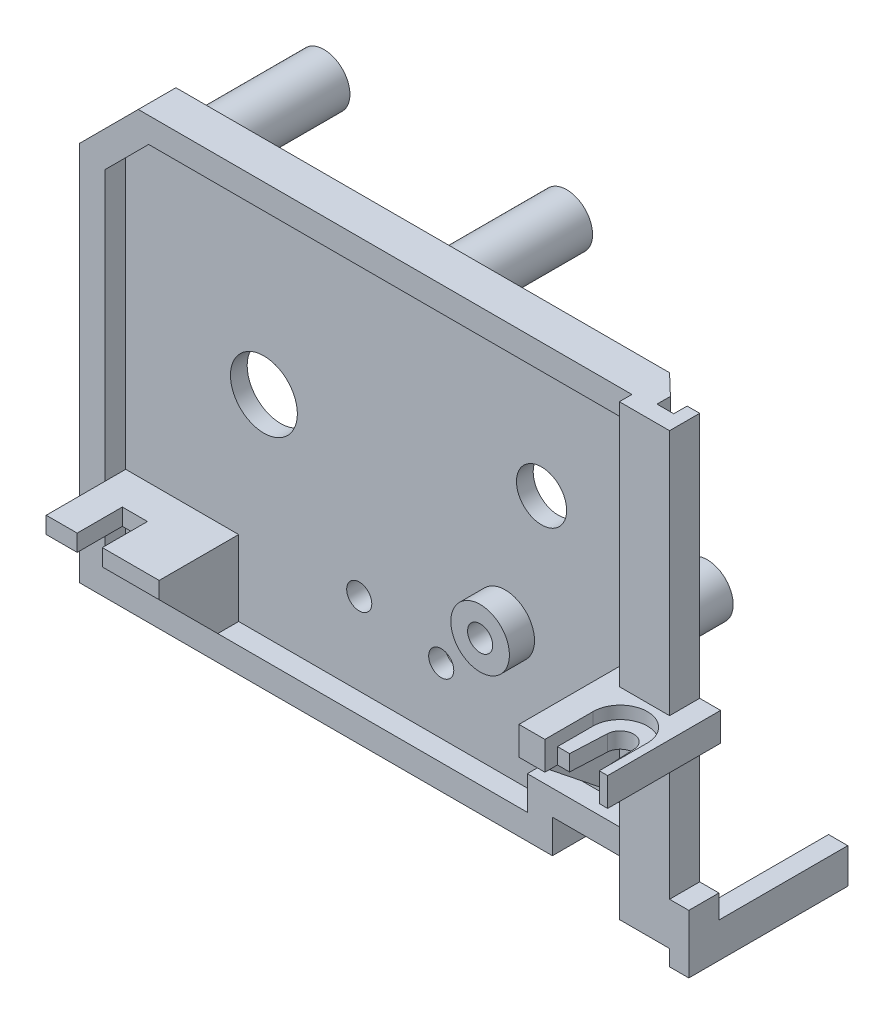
from build123d import *

# Parameters (mm, degrees)
EXTRUSION1_DEPTH                     = 4.5
ENL_V_MAT_EXTRU_1_DEPTH              = 2.5
EXTRUSION2_DEPTH                     = 53.6
ESQUISSE6_W                          = 15
ESQUISSE6_H                          = 9
EXTRUSION3_DEPTH                     = 2
ESQUISSE7_W                          = 13.5
ESQUISSE7_H                          = 2
EXTRUSION4_DEPTH                     = 9.5
NERVURE1_REACH                       = 69.546
ESQUISSE8_WALL_W                     = 146.990924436
ESQUISSE8_WALL_H                     = 2
ESQUISSE9_W                          = 3
ESQUISSE9_H                          = 5.4
ENL_V_MAT_EXTRU_2_DEPTH              = 60.889957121
EXTRUSION5_DEPTH                     = 2.3
ESQUISSE11_W                         = 10.6
ESQUISSE11_H                         = 3.4
EXTRUSION6_DEPTH                     = 9.9
ESQUISSE12_W                         = 2.5
ESQUISSE12_H                         = 3.4
EXTRUSION7_DEPTH                     = 3.6
EXTRUSION8_REACH                     = 61.144
ESQUISSE14_W                         = 2.1
ESQUISSE14_H                         = 3.4
ENL_V_MAT_EXTRU_3_DEPTH              = 1.5
ENL_V_MAT_EXTRU_4_DEPTH              = 56.09164368
NERVURE2_REACH                       = 78.886
ESQUISSE17_WALL_W                    = 173.559243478
ESQUISSE17_WALL_H                    = 1
ESQUISSE18_R                         = 3.1
EXTRUSION9_DEPTH                     = 14.7
TROU_TARAUD_M31_D                    = 2.5
TROU_TARAUD_M31_DEPTH                = 7.5
TROU_TARAUD_M31_TIP                  = 0.751075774
ESQUISSE20_R                         = 3
PER_AGE_PIGNON_MOTEUR_DEPTH          = 59.445981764
ESQUISSE21_R                         = 3.5
EXTRUSION10_DEPTH                    = 3
ESQUISSE22_R                         = 1.5
ENL_V_MAT_EXTRU_6_DEPTH              = 60.372828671
ESQUISSE23_R                         = 1.5
PER_AGE_ROUE_INTERMEDIAIRE_2_DEPTH   = 59.445981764
ESQUISSE24_R                         = 1.5
PER_AGE_ROUE_INTERMEDIAIRE_2_1_DEPTH = 59.445981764
ESQUISSE25_R                         = 4
PER_AGE_ROUE_EXCENTRIQUE_DEPTH       = 59.445981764
ESQUISSE26_R                         = 2.25
ESQUISSE26_R_2                       = 1.5
EXTRUSION11_DEPTH                    = 3


with BuildPart() as part:
    # Esquisse1 → Extrusion1 (new body)
    with BuildSketch(Plane.XY):
        Polygon((-31.823552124, -16.226544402), (-31.823552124, 29.273455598), (-24.823552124, 36.273455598), (34.176447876, 36.273455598), (34.176447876, -12.226544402), (24.676447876, -12.226544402), (24.676447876, -16.226544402), align=None)
    extrude(amount=EXTRUSION1_DEPTH)

    # Esquisse4 → Enl_v. mat.-Extru.1 (cut)
    with BuildSketch(Plane.XY.offset(4.5)):
        Polygon((34.176447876, 33.273455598), (-23.580911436, 33.273455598), (-28.823552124, 28.030814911), (-28.823552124, -13.226544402), (21.676447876, -13.226544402), (21.676447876, -9.226544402), (34.176447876, -9.226544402), align=None)
    extrude(amount=-ENL_V_MAT_EXTRU_1_DEPTH, mode=Mode.SUBTRACT)

    # Esquisse5 → Extrusion2 (add)
    with BuildSketch(Plane(origin=(0, 36.273455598, 0), x_dir=(-1, 0, 0), z_dir=(0, 1, 0))):
        Polygon((-34.176447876, 0), (-34.176447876, 6), (-40.176447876, 6), (-40.176447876, 2.4), (-38.676447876, 2.4), (-38.676447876, 4), (-36.676447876, 4), (-36.676447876, 2.4), align=None)
    extrude(amount=-EXTRUSION2_DEPTH)

    # Esquisse6 → Extrusion3 (add)
    with BuildSketch(Plane.ZY.offset(31.823552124)):
        with Locations((-5.4, -2.726544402)):
            Rectangle(ESQUISSE6_W, ESQUISSE6_H)
    extrude(amount=EXTRUSION3_DEPTH)

    # Esquisse7 → Extrusion4 (add)
    with BuildSketch(Plane.XY.offset(2)):
        with Locations((-22.073552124, -5.226544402)):
            Rectangle(ESQUISSE7_W, ESQUISSE7_H)
    extrude(amount=EXTRUSION4_DEPTH)

    # Esquisse8 wall → Nervure1 (add, up to next)
    with BuildSketch(Plane(origin=(-15.323552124, -9.726544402, 8), x_dir=(0, -0.707106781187, -0.707106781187), z_dir=(0, 0.707106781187, -0.707106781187)), mode=Mode.PRIVATE) as nervure1_sk1:
        with Locations((0, 1)):
            Rectangle(ESQUISSE8_WALL_W, ESQUISSE8_WALL_H)
    nervure1_tool1 = extrude(nervure1_sk1.sketch, amount=NERVURE1_REACH, mode=Mode.PRIVATE) - part.part
    add(nervure1_tool1.solids().sort_by_distance((-15.323552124, -9.726544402, 8))[0])

    # Esquisse9 → Enl_v. mat.-Extru.2 (cut, through all)
    with BuildSketch(Plane.XZ.offset(6.226544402)):
        with Locations((-23.623552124, 8.8)):
            Rectangle(ESQUISSE9_W, ESQUISSE9_H)
    extrude(amount=-ENL_V_MAT_EXTRU_2_DEPTH, mode=Mode.SUBTRACT)

    # Esquisse10 → Extrusion5 (add)
    with BuildSketch(Plane(origin=(40.176447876, 0, 0), x_dir=(0, 0, -1), z_dir=(1, 0, 0))):
        Polygon((-6, -12.226544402), (-6, -19.226544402), (13, -19.226544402), (13, -15.026544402), (-2.4, -15.026544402), (-2.4, -12.226544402), align=None)
    extrude(amount=EXTRUSION5_DEPTH)

    # Esquisse11 → Extrusion6 (add)
    with BuildSketch(Plane.XY.offset(6)):
        with Locations((37.376447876, 5.073455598)):
            Rectangle(ESQUISSE11_W, ESQUISSE11_H)
    extrude(amount=EXTRUSION6_DEPTH)

    # Esquisse12 → Extrusion7 (add)
    with BuildSketch(Plane(origin=(0, 0, 6), x_dir=(-1, 0, 0), z_dir=(0, 0, -1))):
        with Locations((-41.426447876, 5.073455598)):
            Rectangle(ESQUISSE12_W, ESQUISSE12_H)
    extrude(amount=EXTRUSION7_DEPTH)

    # Esquisse14 → Extrusion8 (add, up to next)
    with BuildSketch(Plane(origin=(0, 0, 6), x_dir=(-1, 0, 0), z_dir=(0, 0, -1)), mode=Mode.PRIVATE) as extrusion8_sk1:
        with Locations((-33.126447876, 5.073455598)):
            Rectangle(ESQUISSE14_W, ESQUISSE14_H)
    extrusion8_tool1 = extrude(extrusion8_sk1.sketch, amount=EXTRUSION8_REACH, mode=Mode.PRIVATE) - part.part
    add(extrusion8_tool1.solids().sort_by_distance((33.126448, 5.073456, 6))[0])

    # Esquisse15 → Enl_v. mat.-Extru.3 (cut)
    with BuildSketch(Plane(origin=(0, 6.773455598, 0), x_dir=(-1, 0, 0), z_dir=(0, 1, 0))):
        with BuildLine():
            Line((-35.176447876, 15.9), (-41.676447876, 15.9))
            Line((-41.676447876, 15.9), (-41.676447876, 10.15))
            ThreePointArc((-41.676447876, 10.15), (-38.426447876, 6.9), (-35.176447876, 10.15))
            Line((-35.176447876, 10.15), (-35.176447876, 15.9))
        make_face()
    extrude(amount=-ENL_V_MAT_EXTRU_3_DEPTH, mode=Mode.SUBTRACT)

    # Esquisse16 → Enl_v. mat.-Extru.4 (cut, through all)
    with BuildSketch(Plane(origin=(0, 5.273455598, 0), x_dir=(-1, 0, 0), z_dir=(0, 1, 0))):
        with BuildLine():
            Line((-36.626447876, 14.4), (-35.176447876, 14.4))
            Line((-35.176447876, 14.4), (-35.176447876, 15.9))
            Line((-35.176447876, 15.9), (-41.676447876, 15.9))
            Line((-41.676447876, 15.9), (-41.676447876, 14.4))
            Line((-41.676447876, 14.4), (-40.226447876, 14.4))
            Line((-40.226447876, 14.4), (-40.024709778, 10.075442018))
            ThreePointArc((-40.024709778, 10.075442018), (-38.426447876, 8.55), (-36.828185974, 10.075442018))
            Line((-36.828185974, 10.075442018), (-36.626447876, 14.4))
        make_face()
    extrude(amount=-ENL_V_MAT_EXTRU_4_DEPTH, mode=Mode.SUBTRACT)

    # Esquisse17 wall → Nervure2 (add, up to next)
    with BuildSketch(Plane(origin=(32.076447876, -2.176544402, 8.95), x_dir=(0, -0.624009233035, -0.781416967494), z_dir=(0, -0.781416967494, 0.624009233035)), mode=Mode.PRIVATE) as nervure2_sk1:
        with Locations((0, 0.5)):
            Rectangle(ESQUISSE17_WALL_W, ESQUISSE17_WALL_H)
    nervure2_tool1 = extrude(nervure2_sk1.sketch, amount=-NERVURE2_REACH, mode=Mode.PRIVATE) - part.part
    add(nervure2_tool1.solids().sort_by_distance((32.076447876, -2.176544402, 8.95))[0])

    # Esquisse18 → Extrusion9 (add)
    with BuildSketch(Plane(origin=(0, 0, 0), x_dir=(-1, 0, 0), z_dir=(0, 0, -1))):
        with Locations((21.823552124, 31.273455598)):
            Circle(ESQUISSE18_R)
        with Locations((-7.176447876, 31.273455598)):
            Circle(ESQUISSE18_R)
        with Locations((-23.976447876, 1.373455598)):
            Circle(ESQUISSE18_R)
        with Locations((20.523552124, -10.226544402)):
            Circle(ESQUISSE18_R)
    extrude(amount=EXTRUSION9_DEPTH)

    # Trou taraud_ M31
    with Locations(Plane(origin=(7.176447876, 31.273455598, -14.7), x_dir=(-1, 0, 0), z_dir=(0, 0, -1))):
        with Locations((0, 0), (29, 0), (-16.8, -29.9), (27.7, -41.5)):
            Hole(TROU_TARAUD_M31_D / 2, depth=TROU_TARAUD_M31_DEPTH)
            with Locations((0, 0, -(TROU_TARAUD_M31_DEPTH + TROU_TARAUD_M31_TIP / 2))):  # 118° drill point
                Cone(0, TROU_TARAUD_M31_D / 2, TROU_TARAUD_M31_TIP, mode=Mode.SUBTRACT)

    # Esquisse20 → Per_age pignon moteur (cut, through all)
    with BuildSketch(Plane.XY.offset(2)):
        with Locations((20.876447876, 17.873455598)):
            Circle(ESQUISSE20_R)
    extrude(amount=-PER_AGE_PIGNON_MOTEUR_DEPTH, mode=Mode.SUBTRACT)

    # Esquisse21 → Extrusion10 (add)
    with BuildSketch(Plane.XY.offset(2)):
        with Locations((16.536088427, 2.473414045)):
            Circle(ESQUISSE21_R)
    extrude(amount=EXTRUSION10_DEPTH)

    # Esquisse22 → Enl_v. mat.-Extru.6 (cut, through all)
    with BuildSketch(Plane.XY.offset(5)):
        with Locations((16.536088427, 2.473414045)):
            Circle(ESQUISSE22_R)
    extrude(amount=-ENL_V_MAT_EXTRU_6_DEPTH, mode=Mode.SUBTRACT)

    # Esquisse23 → Per_age roue intermediaire 2 (cut, through all)
    with BuildSketch(Plane.XY.offset(2)):
        with Locations((8.886088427, -5.430856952)):
            Circle(ESQUISSE23_R)
    extrude(amount=-PER_AGE_ROUE_INTERMEDIAIRE_2_DEPTH, mode=Mode.SUBTRACT)

    # Esquisse24 → Per_age roue intermediaire 2_1 (cut, through all)
    with BuildSketch(Plane.XY.offset(2)):
        with Locations((-0.911870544, -3.430856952)):
            Circle(ESQUISSE24_R)
    extrude(amount=-PER_AGE_ROUE_INTERMEDIAIRE_2_1_DEPTH, mode=Mode.SUBTRACT)

    # Esquisse25 → Per_age roue excentrique (cut, through all)
    with BuildSketch(Plane.XY.offset(2)):
        with Locations((-12.30659121, 11.773101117)):
            Circle(ESQUISSE25_R)
    extrude(amount=-PER_AGE_ROUE_EXCENTRIQUE_DEPTH, mode=Mode.SUBTRACT)

    # Esquisse26 → Extrusion11 (add)
    with BuildSketch(Plane(origin=(0, 0, 0), x_dir=(-1, 0, 0), z_dir=(0, 0, -1))):
        with Locations((0.911870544, -3.430856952)):
            Circle(ESQUISSE26_R)
        with Locations(Location((0.911870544, -3.430856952, 0), (0, 0, 180))):
            Circle(ESQUISSE26_R_2, mode=Mode.SUBTRACT)
    extrude(amount=EXTRUSION11_DEPTH)


solid = part.part
